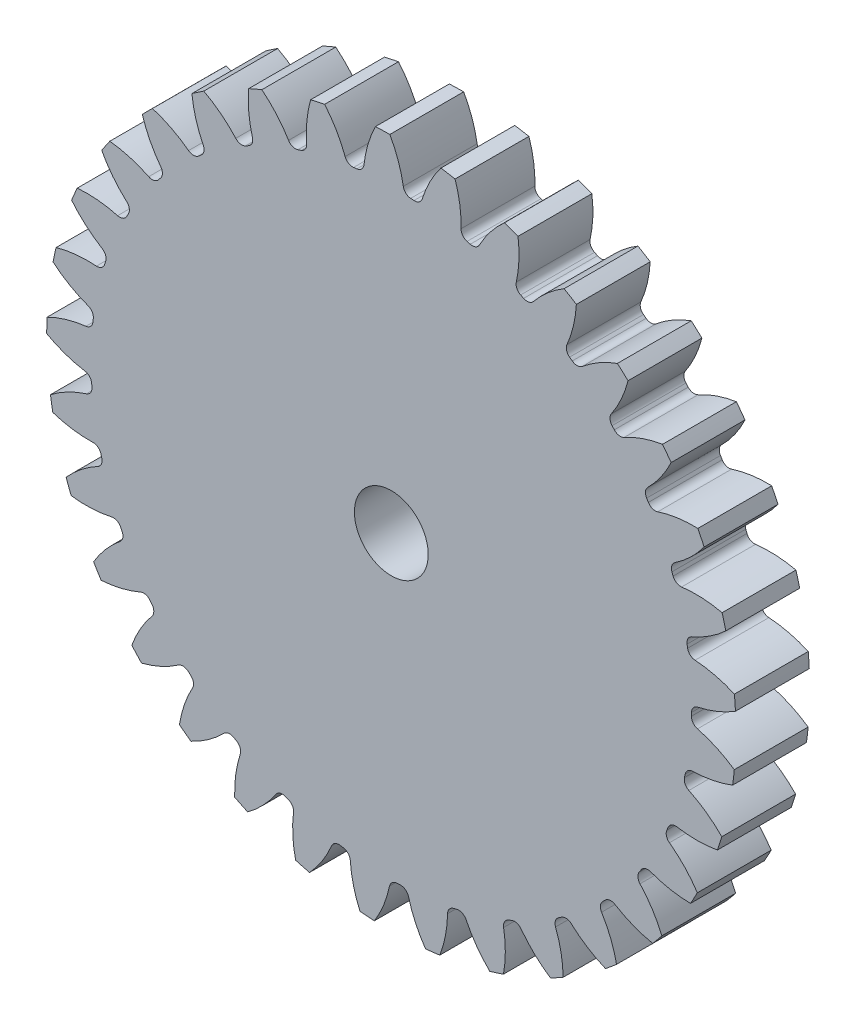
from build123d import *

# Parameters (mm, degrees)
SKETCH3_R         = 592.666666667
GEARBODY_DEPTH    = 127
TOOTHCUT_DEPTH    = 848.724339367
CIRPATTERN1_COUNT = 33
BOREDIA_R         = 63.5
BORE_DEPTH        = 12700


with BuildPart() as part:
    # Sketch3 → gearBody (new body)
    with BuildSketch(Plane.XY):
        Circle(SKETCH3_R)
    extrude(amount=GEARBODY_DEPTH)

    # Sketch2 → toothCut (cut, through all)
    with BuildSketch(Plane.XY):
        with BuildLine():
            ThreePointArc((516.26434078, -14.455041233), (516.336391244, -11.599519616), (516.392647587, -8.743643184))
            ThreePointArc((516.392647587, -8.743643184), (519.527780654, -0.222531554), (527.282550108, 4.499962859))
            ThreePointArc((527.282550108, 4.499962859), (561.158478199, 14.968758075), (592.666666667, 31.22939265))
            ThreePointArc((592.666666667, 31.22939265), (593.339177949, -13.329390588), (590.66632497, -57.813020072))
            ThreePointArc((590.66632497, -57.813020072), (559.920146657, -40.153838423), (526.548520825, -28.174323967))
            ThreePointArc((526.548520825, -28.174323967), (519.013649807, -23.108347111), (516.26434078, -14.455041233))
        make_face()
    toothcut = extrude(amount=TOOTHCUT_DEPTH, mode=Mode.SUBTRACT)

    # CirPattern1: toothCut ×33 about axis
    cirpattern1_axis = Axis((0, 0, 0), (0, 0, 1))
    for i in range(1, CIRPATTERN1_COUNT):
        add(toothcut.rotate(cirpattern1_axis, i * 360 / CIRPATTERN1_COUNT), mode=Mode.SUBTRACT)

    # boreDia → bore (cut, symmetric)
    with BuildSketch(Plane.XY):
        Circle(BOREDIA_R)
    extrude(amount=BORE_DEPTH, both=True, mode=Mode.SUBTRACT)


solid = part.part
